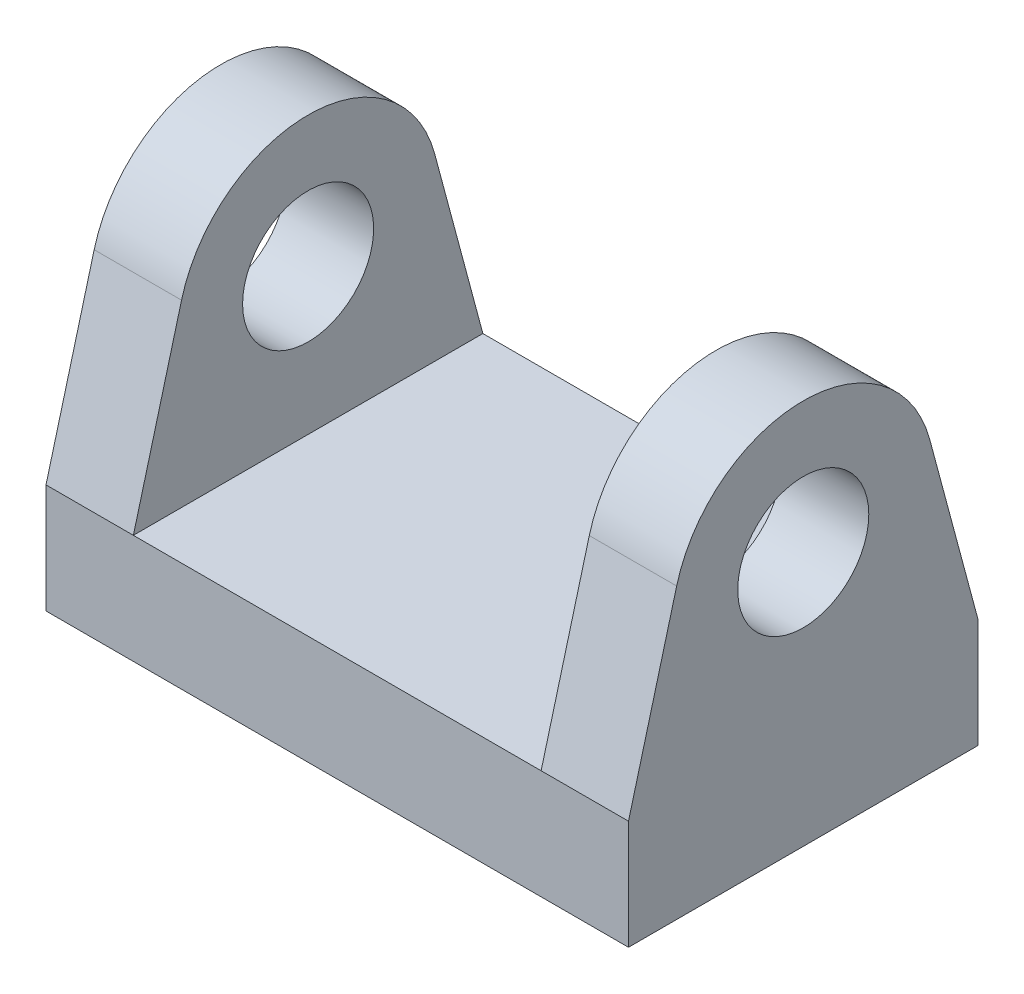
from build123d import *

# Parameters (mm, degrees)
BOSS_EXTRUDE1_DEPTH          = 28
SKETCH2_W                    = 28
SKETCH2_H                    = 24
BOSS_EXTRUDE2_DEPTH          = 7.5
BOSS_EXTRUDE3_DEPTH          = 6
BOSS_EXTRUDE4_START          = 6
BOSS_EXTRUDE4_DEPTH          = 6
CUT_EXTRUDE1_START           = -28
CUT_EXTRUDE1_DEPTH           = 28
F_9_0_9_DIAMETER_HOLE1_D     = 9
F_9_0_9_DIAMETER_HOLE1_DEPTH = 6
F_9_0_9_DIAMETER_HOLE2_D     = 9
F_9_0_9_DIAMETER_HOLE2_DEPTH = 40


with BuildPart() as part:
    # Sketch1 → Boss-Extrude1 (new body)
    with BuildSketch(Plane(origin=(14, 0, 0), x_dir=(0, 0, -1), z_dir=(1, 0, 0))):
        with BuildLine():
            Line((-8.692799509, 19.83135941), (-12, 7.5))
            Line((-12, 7.5), (12, 7.5))
            Line((12, 7.5), (8.692799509, 19.83135941))
            ThreePointArc((8.692799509, 19.83135941), (0, 26.5), (-8.692799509, 19.83135941))
        make_face()
    extrude(amount=-BOSS_EXTRUDE1_DEPTH)

    # Sketch2 → Boss-Extrude2 (add)
    with BuildSketch(Plane.XZ.offset(-7.5)):
        Rectangle(SKETCH2_W, SKETCH2_H)
    extrude(amount=BOSS_EXTRUDE2_DEPTH)

    # Sketch3 → Boss-Extrude3 (add)
    with BuildSketch(Plane.ZY.offset(14)):
        with BuildLine():
            Line((12, 0), (-12, 0))
            Line((-12, 0), (-12, 7.5))
            Line((-12, 7.5), (-8.692799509, 19.83135941))
            ThreePointArc((-8.692799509, 19.83135941), (0, 26.5), (8.692799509, 19.83135941))
            Line((8.692799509, 19.83135941), (12, 7.5))
            Line((12, 7.5), (12, 0))
        make_face()
    extrude(amount=BOSS_EXTRUDE3_DEPTH)

    # Sketch4 → Boss-Extrude4 (add)
    with BuildSketch(Plane(origin=(14, 0, 0), x_dir=(0, 0, -1), z_dir=(1, 0, 0)).offset(BOSS_EXTRUDE4_START)):
        with BuildLine():
            Line((12, 0), (-12, 0))
            Line((-12, 0), (-12, 7.5))
            Line((-12, 7.5), (-8.692799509, 19.83135941))
            ThreePointArc((-8.692799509, 19.83135941), (0, 26.5), (8.692799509, 19.83135941))
            Line((8.692799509, 19.83135941), (12, 7.5))
            Line((12, 7.5), (12, 0))
        make_face()
    extrude(amount=-BOSS_EXTRUDE4_DEPTH)

    # Sketch9 → Cut-Extrude1 (cut)
    with BuildSketch(Plane.ZY.offset(14).offset(CUT_EXTRUDE1_START)):
        with BuildLine():
            Line((12, 7.5), (8.692799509, 19.83135941))
            ThreePointArc((8.692799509, 19.83135941), (0, 26.5), (-8.692799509, 19.83135941))
            Line((-8.692799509, 19.83135941), (-12, 7.5))
            Line((-12, 7.5), (12, 7.5))
        make_face()
    extrude(amount=CUT_EXTRUDE1_DEPTH, mode=Mode.SUBTRACT)

    # 9.0 _9_ Diameter Hole1
    with Locations(Plane(origin=(20, 0, 0), x_dir=(0, 0, -1), z_dir=(1, 0, 0))):
        with Locations((0, 17.5)):
            Hole(F_9_0_9_DIAMETER_HOLE1_D / 2, depth=F_9_0_9_DIAMETER_HOLE1_DEPTH)

    # 9.0 _9_ Diameter Hole2
    with Locations(Plane.ZY.offset(20)):
        with Locations((0, 17.5)):
            Hole(F_9_0_9_DIAMETER_HOLE2_D / 2, depth=F_9_0_9_DIAMETER_HOLE2_DEPTH)


solid = part.part
